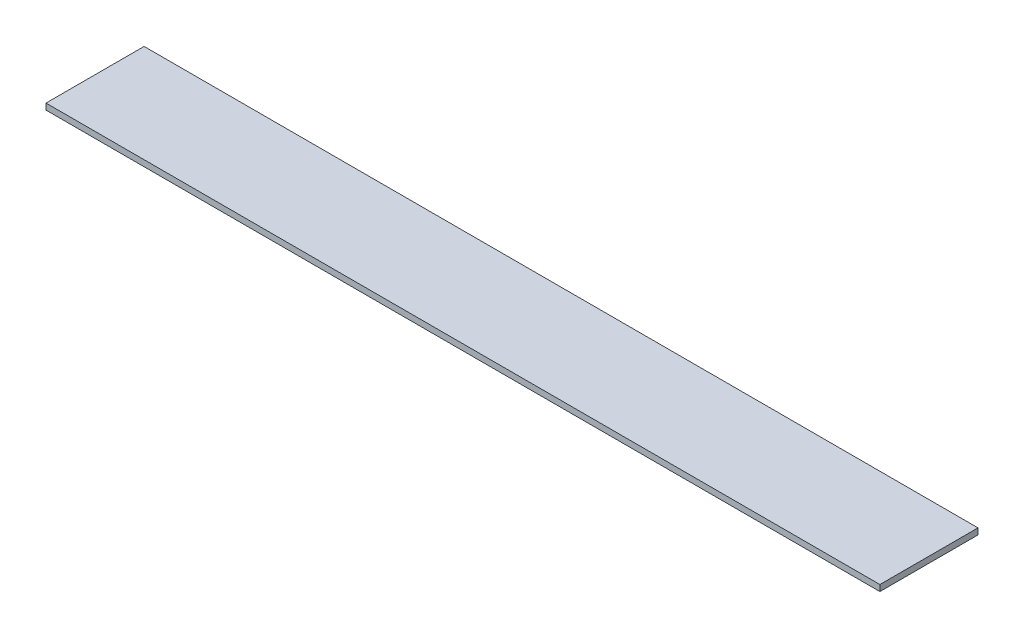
from build123d import *

# Parameters (mm, degrees)
SKETCH1_W           = 431.8
SKETCH1_H           = 50.8
BOSS_EXTRUDE1_DEPTH = 3.175


with BuildPart() as part:
    # Sketch1 → Boss-Extrude1 (new body)
    with BuildSketch(Plane(origin=(0, 0, 0), x_dir=(1, 0, 0), z_dir=(0, 1, 0))):
        Rectangle(SKETCH1_W, SKETCH1_H)
    extrude(amount=BOSS_EXTRUDE1_DEPTH)


solid = part.part
